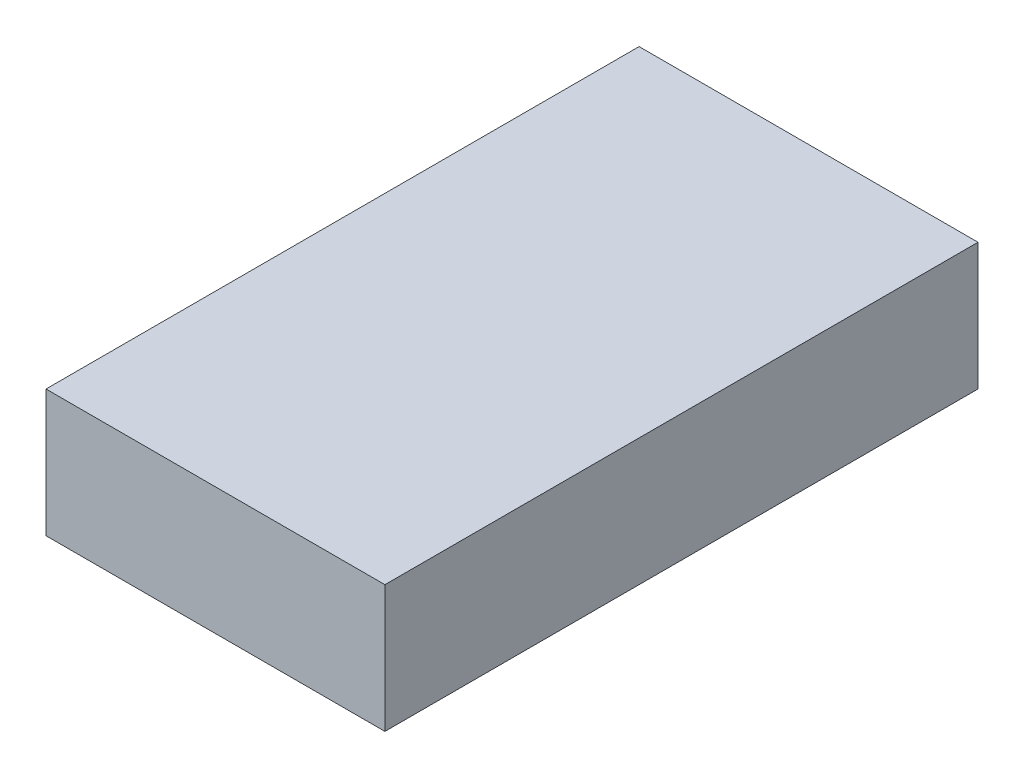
from build123d import *

# Parameters (mm, degrees)
PROFILE_W = 50.8
PROFILE_H = 19.05


with BuildPart() as part:
    # Sweep4: sweep along a path in Upper guide_Path
    with BuildLine(Plane(origin=(0, 19.05, 0), x_dir=(-1, 0, 0), z_dir=(0, 1, 0))) as sweep4_path:
        Line((25.4, 0), (25.4, -88.9))
    # Profile → Sweep4 (sweep)
    with BuildSketch(Plane.XY):
        with Locations((0, 9.525)):
            Rectangle(PROFILE_W, PROFILE_H)
    sweep(path=sweep4_path.line)


solid = part.part
